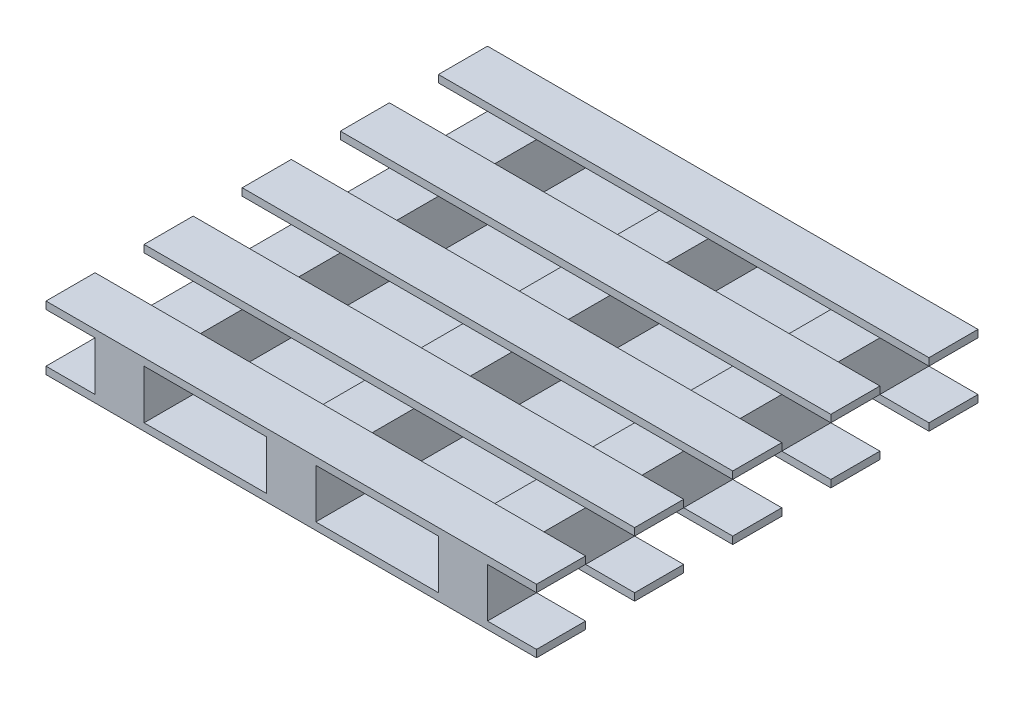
from build123d import *

# Parameters (mm, degrees)
ESQUISSE1_W                = 1000
ESQUISSE1_H                = 900
BOSS_EXTRU_1_DEPTH         = 15
ESQUISSE2_W                = 100
ESQUISSE2_H                = 900
BOSS_EXTRU_2_DEPTH         = 100
ESQUISSE3_W                = 1000
ESQUISSE3_H                = 900
BOSS_EXTRU_3_DEPTH         = 15
ESQUISSE4_W                = 1000
ESQUISSE4_H                = 100
ENL_V_MAT_EXTRU_1_DEPTH    = 15
ESQUISSE5_W                = 1000
ESQUISSE5_H                = 100
ENL_V_MAT_EXTRU_2_DEPTH    = 15
R_P_TITION_LIN_AIRE1_COUNT = 4
R_P_TITION_LIN_AIRE1_PITCH = 200


with BuildPart() as part:
    # Esquisse1 → Boss.-Extru.1 (new body)
    with BuildSketch(Plane(origin=(0, 0, 0), x_dir=(1, 0, 0), z_dir=(0, 1, 0))):
        Rectangle(ESQUISSE1_W, ESQUISSE1_H)
    extrude(amount=BOSS_EXTRU_1_DEPTH)

    # Esquisse2 → Boss.-Extru.2 (add)
    with BuildSketch(Plane(origin=(0, 15, 0), x_dir=(1, 0, 0), z_dir=(0, 1, 0))):
        with Locations((-350, 0)):
            Rectangle(ESQUISSE2_W, ESQUISSE2_H)
        Rectangle(ESQUISSE2_W, ESQUISSE2_H)
        with Locations((350, 0)):
            Rectangle(ESQUISSE2_W, ESQUISSE2_H)
    extrude(amount=BOSS_EXTRU_2_DEPTH)

    # Esquisse3 → Boss.-Extru.3 (add)
    with BuildSketch(Plane(origin=(0, 115, 0), x_dir=(1, 0, 0), z_dir=(0, 1, 0))):
        Rectangle(ESQUISSE3_W, ESQUISSE3_H)
    extrude(amount=BOSS_EXTRU_3_DEPTH)

    # Esquisse4 → Enl_v. mat.-Extru.1 (cut)
    with BuildSketch(Plane(origin=(0, 130, 0), x_dir=(1, 0, 0), z_dir=(0, 1, 0))):
        with Locations((0, -300)):
            Rectangle(ESQUISSE4_W, ESQUISSE4_H)
    enl_v_mat_extru_1 = extrude(amount=-ENL_V_MAT_EXTRU_1_DEPTH, mode=Mode.SUBTRACT)

    # Esquisse5 → Enl_v. mat.-Extru.2 (cut)
    with BuildSketch(Plane.XZ):
        with Locations((0, 300)):
            Rectangle(ESQUISSE5_W, ESQUISSE5_H)
    enl_v_mat_extru_2 = extrude(amount=-ENL_V_MAT_EXTRU_2_DEPTH, mode=Mode.SUBTRACT)

    # R_p_tition lin_aire1: Enl_v. mat.-Extru.1, Enl_v. mat.-Extru.2 ×4
    with Locations(*[(0, 0, -i * R_P_TITION_LIN_AIRE1_PITCH) for i in range(1, R_P_TITION_LIN_AIRE1_COUNT)]):
        add(enl_v_mat_extru_1, mode=Mode.SUBTRACT)
        add(enl_v_mat_extru_2, mode=Mode.SUBTRACT)


solid = part.part
